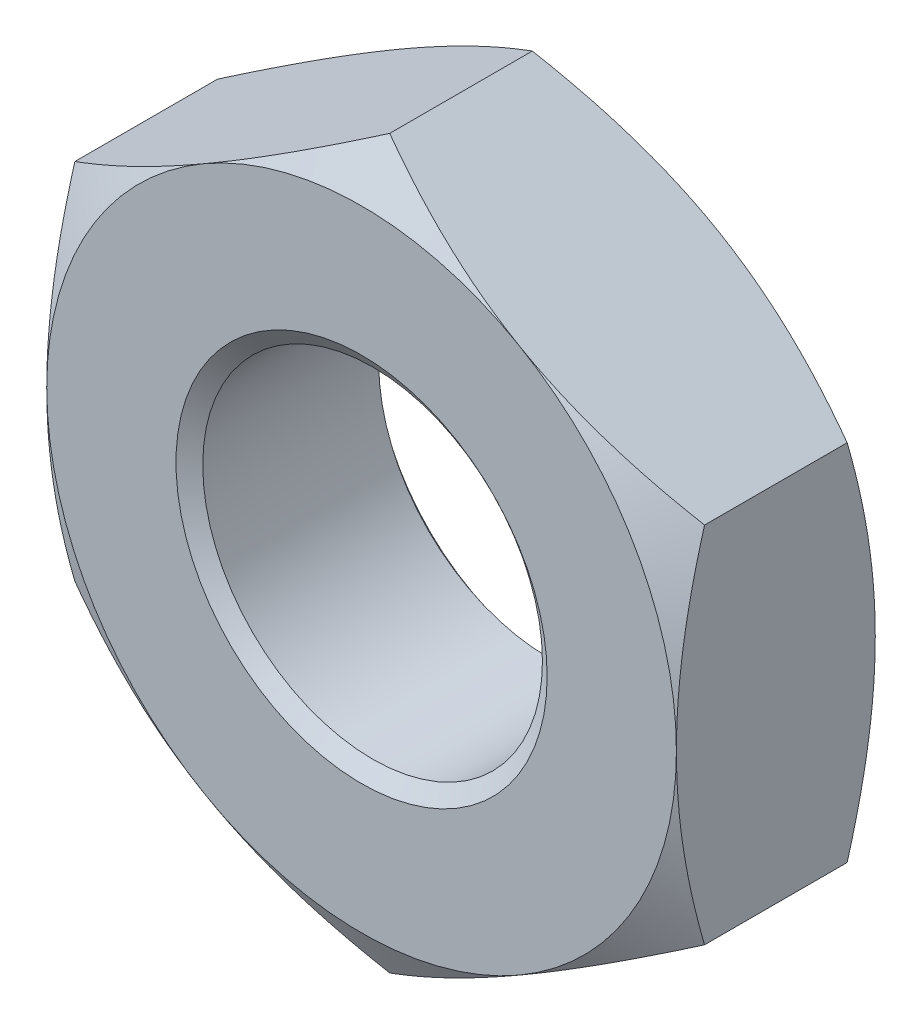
ISO-10303-21;
HEADER;
FILE_DESCRIPTION(('STEP AP214'),'2;1');
FILE_NAME('part.step','',(''),(''),'','','');
FILE_SCHEMA(('AUTOMOTIVE_DESIGN { 1 0 10303 214 1 1 1 1 }'));
ENDSEC;
DATA;
#1=APPLICATION_CONTEXT('core data for automotive mechanical design processes');
#2=APPLICATION_PROTOCOL_DEFINITION('international standard','automotive_design',2000,#1);
#3=PRODUCT_CONTEXT('',#1,'mechanical');
#4=PRODUCT('Part','Part','',(#3));
#5=PRODUCT_RELATED_PRODUCT_CATEGORY('part','',(#4));
#6=PRODUCT_DEFINITION_FORMATION('','',#4);
#7=PRODUCT_DEFINITION_CONTEXT('part definition',#1,'design');
#8=PRODUCT_DEFINITION('design','',#6,#7);
#9=PRODUCT_DEFINITION_SHAPE('','',#8);
#10=(LENGTH_UNIT() NAMED_UNIT(*) SI_UNIT(.MILLI.,.METRE.));
#11=(NAMED_UNIT(*) PLANE_ANGLE_UNIT() SI_UNIT($,.RADIAN.));
#12=(NAMED_UNIT(*) SI_UNIT($,.STERADIAN.) SOLID_ANGLE_UNIT());
#13=UNCERTAINTY_MEASURE_WITH_UNIT(LENGTH_MEASURE(1.E-05),#10,'distance_accuracy_value','');
#14=(GEOMETRIC_REPRESENTATION_CONTEXT(3) GLOBAL_UNCERTAINTY_ASSIGNED_CONTEXT((#13)) GLOBAL_UNIT_ASSIGNED_CONTEXT((#10,
#11,#12)) REPRESENTATION_CONTEXT('',''));
#15=CARTESIAN_POINT('',(0.,0.,0.));
#16=DIRECTION('',(0.,0.,1.));
#17=DIRECTION('',(1.,0.,0.));
#18=AXIS2_PLACEMENT_3D('',#15,#16,#17);
#19=CARTESIAN_POINT('',(0.,0.,-6.));
#20=DIRECTION('',(0.,0.,1.));
#21=DIRECTION('',(1.,0.,0.));
#22=AXIS2_PLACEMENT_3D('',#19,#20,#21);
#23=CYLINDRICAL_SURFACE('',#22,5.125);
#24=CARTESIAN_POINT('',(0.,0.,-0.332598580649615));
#25=DIRECTION('',(0.,0.,1.));
#26=DIRECTION('',(1.,0.,0.));
#27=AXIS2_PLACEMENT_3D('',#24,#25,#26);
#28=CIRCLE('',#27,5.125);
#29=CARTESIAN_POINT('',(5.125,0.,-0.332598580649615));
#30=VERTEX_POINT('',#29);
#31=EDGE_CURVE('E197',#30,#30,#28,.F.);
#32=ORIENTED_EDGE('',*,*,#31,.F.);
#33=EDGE_LOOP('',(#32));
#34=FACE_BOUND('',#33,.T.);
#35=CARTESIAN_POINT('',(0.,0.,-5.64200141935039));
#36=DIRECTION('',(0.,0.,-1.));
#37=DIRECTION('',(-1.,0.,0.));
#38=AXIS2_PLACEMENT_3D('',#35,#36,#37);
#39=CIRCLE('',#38,5.125);
#40=CARTESIAN_POINT('',(-5.125,0.,-5.64200141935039));
#41=VERTEX_POINT('',#40);
#42=EDGE_CURVE('E50',#41,#41,#39,.F.);
#43=ORIENTED_EDGE('',*,*,#42,.F.);
#44=EDGE_LOOP('',(#43));
#45=FACE_BOUND('',#44,.T.);
#46=ADVANCED_FACE('F45',(#34,#45),#23,.F.);
#47=CARTESIAN_POINT('',(0.,10.9696551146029,-6.));
#48=DIRECTION('',(-0.500000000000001,0.866025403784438,0.));
#49=DIRECTION('',(-0.866025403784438,-0.500000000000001,0.));
#50=AXIS2_PLACEMENT_3D('',#47,#48,#49);
#51=PLANE('',#50);
#52=DIRECTION('',(0.,0.,1.));
#53=VECTOR('',#52,1.);
#54=CARTESIAN_POINT('',(-9.5,5.48482755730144,-6.));
#55=LINE('',#54,#53);
#56=CARTESIAN_POINT('',(-9.5,5.48482755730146,-5.15149422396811));
#57=VERTEX_POINT('',#56);
#58=CARTESIAN_POINT('',(-9.5,5.48482755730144,-0.848505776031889));
#59=VERTEX_POINT('',#58);
#60=EDGE_CURVE('E184',#57,#59,#55,.T.);
#61=ORIENTED_EDGE('',*,*,#60,.T.);
#62=CARTESIAN_POINT('',(-9.5002,5.4847120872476,-0.848572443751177));
#63=CARTESIAN_POINT('',(-9.2913692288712,5.60528058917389,-0.778973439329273));
#64=CARTESIAN_POINT('',(-9.08175982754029,5.72629863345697,-0.712533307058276));
#65=CARTESIAN_POINT('',(-8.66086011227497,5.96930519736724,-0.586847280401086));
#66=CARTESIAN_POINT('',(-8.44956926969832,6.09129402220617,-0.527603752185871));
#67=CARTESIAN_POINT('',(-7.81229220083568,6.45922610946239,-0.361814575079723));
#68=CARTESIAN_POINT('',(-7.38379023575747,6.70662183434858,-0.267514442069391));
#69=CARTESIAN_POINT('',(-6.74255666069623,7.07683821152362,-0.156938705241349));
#70=CARTESIAN_POINT('',(-6.53174078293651,7.19855281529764,-0.125439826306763));
#71=CARTESIAN_POINT('',(-6.10913296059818,7.44254555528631,-0.0726182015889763));
#72=CARTESIAN_POINT('',(-5.89734099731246,7.56482370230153,-0.0512956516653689));
#73=CARTESIAN_POINT('',(-5.47340378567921,7.80958396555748,-0.0193730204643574));
#74=CARTESIAN_POINT('',(-5.26125925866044,7.93206566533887,-0.00876019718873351));
#75=CARTESIAN_POINT('',(-4.83677424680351,8.17714220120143,0.00151746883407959));
#76=CARTESIAN_POINT('',(-4.62443376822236,8.29973703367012,0.00118264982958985));
#77=CARTESIAN_POINT('',(-4.22745800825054,8.5289310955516,-0.00967336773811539));
#78=CARTESIAN_POINT('',(-4.04279470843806,8.63554650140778,-0.0188702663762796));
#79=CARTESIAN_POINT('',(-3.67389999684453,8.84852796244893,-0.0453653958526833));
#80=CARTESIAN_POINT('',(-3.48966861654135,8.95489399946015,-0.0626641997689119));
#81=CARTESIAN_POINT('',(-2.93768832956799,9.27357996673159,-0.126304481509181));
#82=CARTESIAN_POINT('',(-2.57091646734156,9.4853358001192,-0.184381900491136));
#83=CARTESIAN_POINT('',(-1.83348217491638,9.91109368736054,-0.329576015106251));
#84=CARTESIAN_POINT('',(-1.46291385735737,10.1250414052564,-0.417308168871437));
#85=CARTESIAN_POINT('',(-0.72730328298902,10.5497463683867,-0.616423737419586));
#86=CARTESIAN_POINT('',(-0.362251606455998,10.7605090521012,-0.727760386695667));
#87=CARTESIAN_POINT('',(0.000199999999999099,10.9697705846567,-0.848572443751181));
#88=B_SPLINE_CURVE_WITH_KNOTS('',3,(#62,#63,#64,#65,#66,#67,#68,#69,#70,#71,#72,#73,#74,#75,#76,
#77,#78,#79,#80,#81,#82,#83,#84,#85,#86,#87),.UNSPECIFIED.,.F.,.F.,(4,2,2,2,2,2,2,2,2,2,2,2,4),
(0.,0.752880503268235,1.50600787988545,3.0154687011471,3.75167336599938,4.48789219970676,
5.22323407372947,5.95855322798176,6.59868084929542,7.23885375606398,8.52010929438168,
9.82978009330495,11.1368800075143),.UNSPECIFIED.);
#89=CARTESIAN_POINT('',(-4.75000000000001,8.22724133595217,0.));
#90=VERTEX_POINT('',#89);
#91=EDGE_CURVE('E73',#59,#90,#88,.T.);
#92=ORIENTED_EDGE('',*,*,#91,.T.);
#93=CARTESIAN_POINT('',(0.,10.9696551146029,-0.848505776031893));
#94=VERTEX_POINT('',#93);
#95=EDGE_CURVE('E274',#90,#94,#88,.T.);
#96=ORIENTED_EDGE('',*,*,#95,.T.);
#97=DIRECTION('',(0.,0.,1.));
#98=VECTOR('',#97,1.);
#99=CARTESIAN_POINT('',(0.,10.9696551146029,-6.));
#100=LINE('',#99,#98);
#101=CARTESIAN_POINT('',(0.,10.9696551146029,-5.15149422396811));
#102=VERTEX_POINT('',#101);
#103=EDGE_CURVE('E165',#102,#94,#100,.T.);
#104=ORIENTED_EDGE('',*,*,#103,.F.);
#105=CARTESIAN_POINT('',(-9.5002,5.4847120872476,-5.15142755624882));
#106=CARTESIAN_POINT('',(-9.2913692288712,5.60528058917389,-5.22102656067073));
#107=CARTESIAN_POINT('',(-9.08175982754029,5.72629863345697,-5.28746669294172));
#108=CARTESIAN_POINT('',(-8.66086011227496,5.96930519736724,-5.41315271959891));
#109=CARTESIAN_POINT('',(-8.44956926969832,6.09129402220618,-5.47239624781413));
#110=CARTESIAN_POINT('',(-7.81229220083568,6.45922610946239,-5.63818542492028));
#111=CARTESIAN_POINT('',(-7.38379023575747,6.70662183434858,-5.73248555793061));
#112=CARTESIAN_POINT('',(-6.74255666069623,7.07683821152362,-5.84306129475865));
#113=CARTESIAN_POINT('',(-6.53174078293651,7.19855281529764,-5.87456017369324));
#114=CARTESIAN_POINT('',(-6.10913296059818,7.44254555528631,-5.92738179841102));
#115=CARTESIAN_POINT('',(-5.89734099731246,7.56482370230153,-5.94870434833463));
#116=CARTESIAN_POINT('',(-5.47340378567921,7.80958396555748,-5.98062697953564));
#117=CARTESIAN_POINT('',(-5.26125925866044,7.93206566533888,-5.99123980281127));
#118=CARTESIAN_POINT('',(-4.83677424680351,8.17714220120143,-6.00151746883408));
#119=CARTESIAN_POINT('',(-4.62443376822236,8.29973703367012,-6.00118264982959));
#120=CARTESIAN_POINT('',(-4.22745800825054,8.5289310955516,-5.99032663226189));
#121=CARTESIAN_POINT('',(-4.04279470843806,8.63554650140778,-5.98112973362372));
#122=CARTESIAN_POINT('',(-3.67389999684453,8.84852796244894,-5.95463460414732));
#123=CARTESIAN_POINT('',(-3.48966861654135,8.95489399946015,-5.93733580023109));
#124=CARTESIAN_POINT('',(-2.93768832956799,9.27357996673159,-5.87369551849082));
#125=CARTESIAN_POINT('',(-2.57091646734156,9.4853358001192,-5.81561809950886));
#126=CARTESIAN_POINT('',(-1.83348217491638,9.91109368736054,-5.67042398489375));
#127=CARTESIAN_POINT('',(-1.46291385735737,10.1250414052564,-5.58269183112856));
#128=CARTESIAN_POINT('',(-0.72730328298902,10.5497463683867,-5.38357626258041));
#129=CARTESIAN_POINT('',(-0.362251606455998,10.7605090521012,-5.27223961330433));
#130=CARTESIAN_POINT('',(0.000199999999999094,10.9697705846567,-5.15142755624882));
#131=B_SPLINE_CURVE_WITH_KNOTS('',3,(#105,#106,#107,#108,#109,#110,#111,#112,#113,#114,#115,
#116,#117,#118,#119,#120,#121,#122,#123,#124,#125,#126,#127,#128,#129,#130),.UNSPECIFIED.,.F.,
.F.,(4,2,2,2,2,2,2,2,2,2,2,2,4),(0.,0.752880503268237,1.50600787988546,3.0154687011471,
3.75167336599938,4.48789219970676,5.22323407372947,5.95855322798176,6.59868084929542,
7.23885375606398,8.52010929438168,9.82978009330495,11.1368800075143),.UNSPECIFIED.);
#132=CARTESIAN_POINT('',(-4.75000000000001,8.22724133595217,-6.));
#133=VERTEX_POINT('',#132);
#134=EDGE_CURVE('E188',#133,#102,#131,.T.);
#135=ORIENTED_EDGE('',*,*,#134,.F.);
#136=EDGE_CURVE('E298',#57,#133,#131,.T.);
#137=ORIENTED_EDGE('',*,*,#136,.F.);
#138=EDGE_LOOP('',(#61,#92,#96,#104,#135,#137));
#139=FACE_BOUND('',#138,.T.);
#140=ADVANCED_FACE('F47',(#139),#51,.T.);
#141=CARTESIAN_POINT('',(9.5,5.48482755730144,-6.));
#142=DIRECTION('',(0.500000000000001,0.866025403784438,0.));
#143=DIRECTION('',(-0.866025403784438,0.500000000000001,0.));
#144=AXIS2_PLACEMENT_3D('',#141,#142,#143);
#145=PLANE('',#144);
#146=ORIENTED_EDGE('',*,*,#103,.T.);
#147=CARTESIAN_POINT('',(-0.000200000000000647,10.9697705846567,-0.848572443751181));
#148=CARTESIAN_POINT('',(0.208630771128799,10.8492020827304,-0.778973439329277));
#149=CARTESIAN_POINT('',(0.418240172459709,10.7281840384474,-0.712533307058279));
#150=CARTESIAN_POINT('',(0.839139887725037,10.4851774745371,-0.586847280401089));
#151=CARTESIAN_POINT('',(1.05043073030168,10.3631886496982,-0.527603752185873));
#152=CARTESIAN_POINT('',(1.68770779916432,9.99525656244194,-0.361814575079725));
#153=CARTESIAN_POINT('',(2.11620976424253,9.74786083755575,-0.267514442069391));
#154=CARTESIAN_POINT('',(2.75744333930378,9.37764446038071,-0.15693870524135));
#155=CARTESIAN_POINT('',(2.96825921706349,9.2559298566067,-0.125439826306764));
#156=CARTESIAN_POINT('',(3.39086703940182,9.01193711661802,-0.0726182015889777));
#157=CARTESIAN_POINT('',(3.60265900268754,8.88965896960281,-0.0512956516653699));
#158=CARTESIAN_POINT('',(4.0265962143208,8.64489870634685,-0.0193730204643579));
#159=CARTESIAN_POINT('',(4.23874074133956,8.52241700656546,-0.00876019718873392));
#160=CARTESIAN_POINT('',(4.66322575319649,8.2773404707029,0.00151746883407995));
#161=CARTESIAN_POINT('',(4.87556623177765,8.15474563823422,0.00118264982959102));
#162=CARTESIAN_POINT('',(5.27254199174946,7.92555157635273,-0.00967336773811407));
#163=CARTESIAN_POINT('',(5.45720529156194,7.81893617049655,-0.0188702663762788));
#164=CARTESIAN_POINT('',(5.82610000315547,7.6059547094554,-0.0453653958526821));
#165=CARTESIAN_POINT('',(6.01033138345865,7.49958867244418,-0.0626641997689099));
#166=CARTESIAN_POINT('',(6.56231167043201,7.18090270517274,-0.126304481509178));
#167=CARTESIAN_POINT('',(6.92908353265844,6.96914687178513,-0.184381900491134));
#168=CARTESIAN_POINT('',(7.66651782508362,6.5433889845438,-0.32957601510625));
#169=CARTESIAN_POINT('',(8.03708614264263,6.32944126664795,-0.417308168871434));
#170=CARTESIAN_POINT('',(8.77269671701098,5.90473630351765,-0.616423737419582));
#171=CARTESIAN_POINT('',(9.137748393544,5.69397361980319,-0.727760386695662));
#172=CARTESIAN_POINT('',(9.5002,5.4847120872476,-0.848572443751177));
#173=B_SPLINE_CURVE_WITH_KNOTS('',3,(#147,#148,#149,#150,#151,#152,#153,#154,#155,#156,#157,
#158,#159,#160,#161,#162,#163,#164,#165,#166,#167,#168,#169,#170,#171,#172),.UNSPECIFIED.,.F.,
.F.,(4,2,2,2,2,2,2,2,2,2,2,2,4),(0.,0.752880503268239,1.50600787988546,3.01546870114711,
3.75167336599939,4.48789219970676,5.22323407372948,5.95855322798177,6.59868084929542,
7.23885375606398,8.52010929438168,9.82978009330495,11.1368800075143),.UNSPECIFIED.);
#174=CARTESIAN_POINT('',(4.75000000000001,8.22724133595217,0.));
#175=VERTEX_POINT('',#174);
#176=EDGE_CURVE('E156',#94,#175,#173,.T.);
#177=ORIENTED_EDGE('',*,*,#176,.T.);
#178=CARTESIAN_POINT('',(9.5,5.48482755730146,-0.848505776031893));
#179=VERTEX_POINT('',#178);
#180=EDGE_CURVE('E141',#175,#179,#173,.T.);
#181=ORIENTED_EDGE('',*,*,#180,.T.);
#182=DIRECTION('',(0.,0.,1.));
#183=VECTOR('',#182,1.);
#184=CARTESIAN_POINT('',(9.5,5.48482755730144,-6.));
#185=LINE('',#184,#183);
#186=CARTESIAN_POINT('',(9.5,5.48482755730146,-5.15149422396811));
#187=VERTEX_POINT('',#186);
#188=EDGE_CURVE('E155',#187,#179,#185,.T.);
#189=ORIENTED_EDGE('',*,*,#188,.F.);
#190=CARTESIAN_POINT('',(-0.000200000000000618,10.9697705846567,-5.15142755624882));
#191=CARTESIAN_POINT('',(0.2086307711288,10.8492020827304,-5.22102656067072));
#192=CARTESIAN_POINT('',(0.418240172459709,10.7281840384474,-5.28746669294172));
#193=CARTESIAN_POINT('',(0.839139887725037,10.4851774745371,-5.41315271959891));
#194=CARTESIAN_POINT('',(1.05043073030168,10.3631886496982,-5.47239624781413));
#195=CARTESIAN_POINT('',(1.68770779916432,9.99525656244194,-5.63818542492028));
#196=CARTESIAN_POINT('',(2.11620976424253,9.74786083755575,-5.73248555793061));
#197=CARTESIAN_POINT('',(2.75744333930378,9.37764446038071,-5.84306129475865));
#198=CARTESIAN_POINT('',(2.96825921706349,9.2559298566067,-5.87456017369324));
#199=CARTESIAN_POINT('',(3.39086703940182,9.01193711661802,-5.92738179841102));
#200=CARTESIAN_POINT('',(3.60265900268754,8.88965896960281,-5.94870434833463));
#201=CARTESIAN_POINT('',(4.0265962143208,8.64489870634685,-5.98062697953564));
#202=CARTESIAN_POINT('',(4.23874074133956,8.52241700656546,-5.99123980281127));
#203=CARTESIAN_POINT('',(4.66322575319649,8.2773404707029,-6.00151746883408));
#204=CARTESIAN_POINT('',(4.87556623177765,8.15474563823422,-6.00118264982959));
#205=CARTESIAN_POINT('',(5.27254199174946,7.92555157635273,-5.99032663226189));
#206=CARTESIAN_POINT('',(5.45720529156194,7.81893617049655,-5.98112973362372));
#207=CARTESIAN_POINT('',(5.82610000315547,7.6059547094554,-5.95463460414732));
#208=CARTESIAN_POINT('',(6.01033138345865,7.49958867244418,-5.93733580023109));
#209=CARTESIAN_POINT('',(6.56231167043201,7.18090270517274,-5.87369551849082));
#210=CARTESIAN_POINT('',(6.92908353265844,6.96914687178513,-5.81561809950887));
#211=CARTESIAN_POINT('',(7.66651782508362,6.5433889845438,-5.67042398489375));
#212=CARTESIAN_POINT('',(8.03708614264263,6.32944126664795,-5.58269183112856));
#213=CARTESIAN_POINT('',(8.77269671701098,5.90473630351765,-5.38357626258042));
#214=CARTESIAN_POINT('',(9.137748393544,5.69397361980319,-5.27223961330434));
#215=CARTESIAN_POINT('',(9.5002,5.4847120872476,-5.15142755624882));
#216=B_SPLINE_CURVE_WITH_KNOTS('',3,(#190,#191,#192,#193,#194,#195,#196,#197,#198,#199,#200,
#201,#202,#203,#204,#205,#206,#207,#208,#209,#210,#211,#212,#213,#214,#215),.UNSPECIFIED.,.F.,
.F.,(4,2,2,2,2,2,2,2,2,2,2,2,4),(0.,0.752880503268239,1.50600787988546,3.01546870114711,
3.75167336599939,4.48789219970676,5.22323407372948,5.95855322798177,6.59868084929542,
7.23885375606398,8.52010929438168,9.82978009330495,11.1368800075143),.UNSPECIFIED.);
#217=CARTESIAN_POINT('',(4.75000000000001,8.22724133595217,-6.));
#218=VERTEX_POINT('',#217);
#219=EDGE_CURVE('E290',#218,#187,#216,.T.);
#220=ORIENTED_EDGE('',*,*,#219,.F.);
#221=EDGE_CURVE('E297',#102,#218,#216,.T.);
#222=ORIENTED_EDGE('',*,*,#221,.F.);
#223=EDGE_LOOP('',(#146,#177,#181,#189,#220,#222));
#224=FACE_BOUND('',#223,.T.);
#225=ADVANCED_FACE('F153',(#224),#145,.T.);
#226=CARTESIAN_POINT('',(9.5,5.48482755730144,-6.));
#227=DIRECTION('',(-1.,0.,0.));
#228=DIRECTION('',(0.,0.,1.));
#229=AXIS2_PLACEMENT_3D('',#226,#227,#228);
#230=PLANE('',#229);
#231=CARTESIAN_POINT('',(9.5,-14.5465709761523,-4.54600370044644));
#232=CARTESIAN_POINT('',(9.5,-14.3380268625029,-4.44519656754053));
#233=CARTESIAN_POINT('',(9.5,-14.129230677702,-4.34491115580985));
#234=CARTESIAN_POINT('',(9.5,-13.7110809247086,-4.14550353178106));
#235=CARTESIAN_POINT('',(9.5,-13.5017273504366,-4.04638133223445));
#236=CARTESIAN_POINT('',(9.5,-12.8726893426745,-3.75091045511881));
#237=CARTESIAN_POINT('',(9.5,-12.4520954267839,-3.55649036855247));
#238=CARTESIAN_POINT('',(9.5,-11.6055942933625,-3.17293577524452));
#239=CARTESIAN_POINT('',(9.5,-11.1796704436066,-2.98383788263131));
#240=CARTESIAN_POINT('',(9.5,-10.3243227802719,-2.61376109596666));
#241=CARTESIAN_POINT('',(9.5,-9.89489915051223,-2.43278177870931));
#242=CARTESIAN_POINT('',(9.5,-9.02653674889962,-2.07895754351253));
#243=CARTESIAN_POINT('',(9.5,-8.58754588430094,-1.90623976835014));
#244=CARTESIAN_POINT('',(9.5,-7.70438743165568,-1.57433108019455));
#245=CARTESIAN_POINT('',(9.5,-7.26021927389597,-1.41514167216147));
#246=CARTESIAN_POINT('',(9.5,-6.36690631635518,-1.11456802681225));
#247=CARTESIAN_POINT('',(9.5,-5.9177743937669,-0.97314593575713));
#248=CARTESIAN_POINT('',(9.5,-5.01314169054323,-0.712697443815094));
#249=CARTESIAN_POINT('',(9.5,-4.55764297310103,-0.593663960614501));
#250=CARTESIAN_POINT('',(9.5,-3.6398894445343,-0.383780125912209));
#251=CARTESIAN_POINT('',(9.5,-3.17763286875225,-0.292937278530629));
#252=CARTESIAN_POINT('',(9.5,-2.48018032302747,-0.182364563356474));
#253=CARTESIAN_POINT('',(9.5,-2.24698958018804,-0.149786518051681));
#254=CARTESIAN_POINT('',(9.5,-1.77951479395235,-0.0938352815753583));
#255=CARTESIAN_POINT('',(9.5,-1.54523086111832,-0.070461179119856));
#256=CARTESIAN_POINT('',(9.5,-1.07737258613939,-0.033546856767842));
#257=CARTESIAN_POINT('',(9.5,-0.843803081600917,-0.0199455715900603));
#258=CARTESIAN_POINT('',(9.5,-0.376297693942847,-0.00264879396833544));
#259=CARTESIAN_POINT('',(9.5,-0.14236181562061,0.00104682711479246));
#260=CARTESIAN_POINT('',(9.5,0.325389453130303,-0.00155578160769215));
#261=CARTESIAN_POINT('',(9.5,0.559204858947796,-0.00785120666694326));
#262=CARTESIAN_POINT('',(9.5,1.02636653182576,-0.030279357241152));
#263=CARTESIAN_POINT('',(9.5,1.25971277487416,-0.0464125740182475));
#264=CARTESIAN_POINT('',(9.5,1.82527222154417,-0.0971001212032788));
#265=CARTESIAN_POINT('',(9.5,2.15705089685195,-0.136583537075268));
#266=CARTESIAN_POINT('',(9.5,2.81806585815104,-0.233246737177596));
#267=CARTESIAN_POINT('',(9.5,3.14730142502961,-0.290431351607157));
#268=CARTESIAN_POINT('',(9.5,3.80295855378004,-0.420468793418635));
#269=CARTESIAN_POINT('',(9.5,4.12937714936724,-0.4933364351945));
#270=CARTESIAN_POINT('',(9.5,4.77885595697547,-0.652516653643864));
#271=CARTESIAN_POINT('',(9.5,5.10191648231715,-0.738827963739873));
#272=CARTESIAN_POINT('',(9.5,5.75263605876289,-0.925086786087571));
#273=CARTESIAN_POINT('',(9.5,6.08021372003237,-1.02531669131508));
#274=CARTESIAN_POINT('',(9.5,6.73190653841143,-1.23567979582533));
#275=CARTESIAN_POINT('',(9.5,7.05602391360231,-1.34580616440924));
#276=CARTESIAN_POINT('',(9.5,7.6994955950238,-1.5736874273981));
#277=CARTESIAN_POINT('',(9.5,8.01886644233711,-1.69139589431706));
#278=CARTESIAN_POINT('',(9.5,8.65513026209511,-1.93372164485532));
#279=CARTESIAN_POINT('',(9.5,8.97202217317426,-2.05834172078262));
#280=CARTESIAN_POINT('',(9.5,9.28776285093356,-2.18573389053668));
#281=B_SPLINE_CURVE_WITH_KNOTS('',3,(#231,#232,#233,#234,#235,#236,#237,#238,#239,#240,#241,
#242,#243,#244,#245,#246,#247,#248,#249,#250,#251,#252,#253,#254,#255,#256,#257,#258,#259,#260,
#261,#262,#263,#264,#265,#266,#267,#268,#269,#270,#271,#272,#273,#274,#275,#276,#277,#278,#279,
#280),.UNSPECIFIED.,.F.,.F.,(4,2,2,2,2,2,2,2,2,2,2,2,2,2,2,2,2,2,2,2,2,2,2,2,4),(0.,
0.694890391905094,1.38978839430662,2.7798104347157,4.17778700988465,5.57569062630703,
6.99075616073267,8.40597890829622,9.81813342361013,11.2298404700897,12.6419229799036,
13.3481360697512,14.0542792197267,14.7559707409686,15.4576531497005,16.1591386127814,
16.8606591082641,17.8624602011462,18.8645349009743,19.8675603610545,20.8704913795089,
21.8980064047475,22.9248175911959,23.9458491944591,24.9672963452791),.UNSPECIFIED.);
#282=CARTESIAN_POINT('',(9.5,-5.48482755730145,-0.848505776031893));
#283=VERTEX_POINT('',#282);
#284=CARTESIAN_POINT('',(9.5,0.,0.));
#285=VERTEX_POINT('',#284);
#286=EDGE_CURVE('E148',#283,#285,#281,.T.);
#287=ORIENTED_EDGE('',*,*,#286,.F.);
#288=DIRECTION('',(0.,0.,1.));
#289=VECTOR('',#288,1.);
#290=CARTESIAN_POINT('',(9.5,-5.48482755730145,-6.));
#291=LINE('',#290,#289);
#292=CARTESIAN_POINT('',(9.5,-5.48482755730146,-5.15149422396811));
#293=VERTEX_POINT('',#292);
#294=EDGE_CURVE('E166',#293,#283,#291,.T.);
#295=ORIENTED_EDGE('',*,*,#294,.F.);
#296=CARTESIAN_POINT('',(9.5,-14.5465709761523,-1.45399629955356));
#297=CARTESIAN_POINT('',(9.5,-14.3380268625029,-1.55480343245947));
#298=CARTESIAN_POINT('',(9.5,-14.129230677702,-1.65508884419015));
#299=CARTESIAN_POINT('',(9.5,-13.7110809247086,-1.85449646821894));
#300=CARTESIAN_POINT('',(9.5,-13.5017273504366,-1.95361866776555));
#301=CARTESIAN_POINT('',(9.5,-12.8726893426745,-2.24908954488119));
#302=CARTESIAN_POINT('',(9.5,-12.4520954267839,-2.44350963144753));
#303=CARTESIAN_POINT('',(9.5,-11.6055942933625,-2.82706422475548));
#304=CARTESIAN_POINT('',(9.5,-11.1796704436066,-3.01616211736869));
#305=CARTESIAN_POINT('',(9.5,-10.3243227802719,-3.38623890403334));
#306=CARTESIAN_POINT('',(9.5,-9.89489915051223,-3.56721822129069));
#307=CARTESIAN_POINT('',(9.5,-9.02653674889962,-3.92104245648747));
#308=CARTESIAN_POINT('',(9.5,-8.58754588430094,-4.09376023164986));
#309=CARTESIAN_POINT('',(9.5,-7.70438743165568,-4.42566891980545));
#310=CARTESIAN_POINT('',(9.5,-7.26021927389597,-4.58485832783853));
#311=CARTESIAN_POINT('',(9.5,-6.36690631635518,-4.88543197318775));
#312=CARTESIAN_POINT('',(9.5,-5.9177743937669,-5.02685406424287));
#313=CARTESIAN_POINT('',(9.5,-5.01314169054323,-5.28730255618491));
#314=CARTESIAN_POINT('',(9.5,-4.55764297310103,-5.4063360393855));
#315=CARTESIAN_POINT('',(9.5,-3.6398894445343,-5.61621987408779));
#316=CARTESIAN_POINT('',(9.5,-3.17763286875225,-5.70706272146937));
#317=CARTESIAN_POINT('',(9.5,-2.48018032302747,-5.81763543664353));
#318=CARTESIAN_POINT('',(9.5,-2.24698958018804,-5.85021348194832));
#319=CARTESIAN_POINT('',(9.5,-1.77951479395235,-5.90616471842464));
#320=CARTESIAN_POINT('',(9.5,-1.54523086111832,-5.92953882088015));
#321=CARTESIAN_POINT('',(9.5,-1.07737258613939,-5.96645314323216));
#322=CARTESIAN_POINT('',(9.5,-0.843803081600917,-5.98005442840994));
#323=CARTESIAN_POINT('',(9.5,-0.376297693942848,-5.99735120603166));
#324=CARTESIAN_POINT('',(9.5,-0.14236181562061,-6.00104682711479));
#325=CARTESIAN_POINT('',(9.5,0.325389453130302,-5.99844421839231));
#326=CARTESIAN_POINT('',(9.5,0.559204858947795,-5.99214879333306));
#327=CARTESIAN_POINT('',(9.5,1.02636653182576,-5.96972064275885));
#328=CARTESIAN_POINT('',(9.5,1.25971277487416,-5.95358742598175));
#329=CARTESIAN_POINT('',(9.5,1.82527222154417,-5.90289987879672));
#330=CARTESIAN_POINT('',(9.5,2.15705089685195,-5.86341646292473));
#331=CARTESIAN_POINT('',(9.5,2.81806585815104,-5.76675326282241));
#332=CARTESIAN_POINT('',(9.5,3.14730142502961,-5.70956864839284));
#333=CARTESIAN_POINT('',(9.5,3.80295855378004,-5.57953120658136));
#334=CARTESIAN_POINT('',(9.5,4.12937714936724,-5.5066635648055));
#335=CARTESIAN_POINT('',(9.5,4.77885595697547,-5.34748334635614));
#336=CARTESIAN_POINT('',(9.5,5.10191648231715,-5.26117203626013));
#337=CARTESIAN_POINT('',(9.5,5.75263605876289,-5.07491321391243));
#338=CARTESIAN_POINT('',(9.5,6.08021372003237,-4.97468330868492));
#339=CARTESIAN_POINT('',(9.5,6.73190653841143,-4.76432020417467));
#340=CARTESIAN_POINT('',(9.5,7.05602391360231,-4.65419383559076));
#341=CARTESIAN_POINT('',(9.5,7.6994955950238,-4.4263125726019));
#342=CARTESIAN_POINT('',(9.5,8.01886644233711,-4.30860410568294));
#343=CARTESIAN_POINT('',(9.5,8.65513026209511,-4.06627835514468));
#344=CARTESIAN_POINT('',(9.5,8.97202217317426,-3.94165827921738));
#345=CARTESIAN_POINT('',(9.5,9.28776285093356,-3.81426610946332));
#346=B_SPLINE_CURVE_WITH_KNOTS('',3,(#296,#297,#298,#299,#300,#301,#302,#303,#304,#305,#306,
#307,#308,#309,#310,#311,#312,#313,#314,#315,#316,#317,#318,#319,#320,#321,#322,#323,#324,#325,
#326,#327,#328,#329,#330,#331,#332,#333,#334,#335,#336,#337,#338,#339,#340,#341,#342,#343,#344,
#345),.UNSPECIFIED.,.F.,.F.,(4,2,2,2,2,2,2,2,2,2,2,2,2,2,2,2,2,2,2,2,2,2,2,2,4),(0.,
0.694890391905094,1.38978839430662,2.7798104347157,4.17778700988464,5.57569062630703,
6.99075616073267,8.40597890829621,9.81813342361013,11.2298404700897,12.6419229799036,
13.3481360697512,14.0542792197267,14.7559707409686,15.4576531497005,16.1591386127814,
16.8606591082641,17.8624602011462,18.8645349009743,19.8675603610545,20.8704913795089,
21.8980064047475,22.9248175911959,23.9458491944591,24.9672963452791),.UNSPECIFIED.);
#347=CARTESIAN_POINT('',(9.5,0.,-6.));
#348=VERTEX_POINT('',#347);
#349=EDGE_CURVE('E305',#293,#348,#346,.T.);
#350=ORIENTED_EDGE('',*,*,#349,.T.);
#351=EDGE_CURVE('E163',#348,#187,#346,.T.);
#352=ORIENTED_EDGE('',*,*,#351,.T.);
#353=ORIENTED_EDGE('',*,*,#188,.T.);
#354=EDGE_CURVE('E138',#285,#179,#281,.T.);
#355=ORIENTED_EDGE('',*,*,#354,.F.);
#356=EDGE_LOOP('',(#287,#295,#350,#352,#353,#355));
#357=FACE_BOUND('',#356,.T.);
#358=ADVANCED_FACE('F160',(#357),#230,.F.);
#359=CARTESIAN_POINT('',(0.,-10.9696551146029,-6.));
#360=DIRECTION('',(0.500000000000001,-0.866025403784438,0.));
#361=DIRECTION('',(0.866025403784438,0.500000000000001,0.));
#362=AXIS2_PLACEMENT_3D('',#359,#360,#361);
#363=PLANE('',#362);
#364=ORIENTED_EDGE('',*,*,#294,.T.);
#365=CARTESIAN_POINT('',(9.5002,-5.48471208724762,-0.84857244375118));
#366=CARTESIAN_POINT('',(9.2913692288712,-5.60528058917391,-0.778973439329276));
#367=CARTESIAN_POINT('',(9.08175982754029,-5.72629863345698,-0.71253330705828));
#368=CARTESIAN_POINT('',(8.66086011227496,-5.96930519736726,-0.58684728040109));
#369=CARTESIAN_POINT('',(8.44956926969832,-6.09129402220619,-0.527603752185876));
#370=CARTESIAN_POINT('',(7.81229220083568,-6.45922610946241,-0.361814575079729));
#371=CARTESIAN_POINT('',(7.38379023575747,-6.70662183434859,-0.267514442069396));
#372=CARTESIAN_POINT('',(6.74255666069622,-7.07683821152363,-0.156938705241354));
#373=CARTESIAN_POINT('',(6.53174078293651,-7.19855281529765,-0.125439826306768));
#374=CARTESIAN_POINT('',(6.10913296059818,-7.44254555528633,-0.0726182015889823));
#375=CARTESIAN_POINT('',(5.89734099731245,-7.56482370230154,-0.0512956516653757));
#376=CARTESIAN_POINT('',(5.4734037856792,-7.8095839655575,-0.0193730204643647));
#377=CARTESIAN_POINT('',(5.26125925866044,-7.93206566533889,-0.0087601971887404));
#378=CARTESIAN_POINT('',(4.83677424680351,-8.17714220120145,0.0015174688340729));
#379=CARTESIAN_POINT('',(4.62443376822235,-8.29973703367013,0.00118264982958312));
#380=CARTESIAN_POINT('',(4.22745800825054,-8.52893109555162,-0.00967336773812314));
#381=CARTESIAN_POINT('',(4.04279470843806,-8.6355465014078,-0.0188702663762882));
#382=CARTESIAN_POINT('',(3.67389999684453,-8.84852796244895,-0.0453653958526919));
#383=CARTESIAN_POINT('',(3.48966861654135,-8.95489399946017,-0.0626641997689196));
#384=CARTESIAN_POINT('',(2.93768832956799,-9.2735799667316,-0.126304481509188));
#385=CARTESIAN_POINT('',(2.57091646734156,-9.48533580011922,-0.184381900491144));
#386=CARTESIAN_POINT('',(1.83348217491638,-9.91109368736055,-0.329576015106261));
#387=CARTESIAN_POINT('',(1.46291385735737,-10.1250414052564,-0.417308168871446));
#388=CARTESIAN_POINT('',(0.72730328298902,-10.5497463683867,-0.616423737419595));
#389=CARTESIAN_POINT('',(0.362251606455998,-10.7605090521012,-0.727760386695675));
#390=CARTESIAN_POINT('',(-0.000199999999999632,-10.9697705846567,-0.84857244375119));
#391=B_SPLINE_CURVE_WITH_KNOTS('',3,(#365,#366,#367,#368,#369,#370,#371,#372,#373,#374,#375,
#376,#377,#378,#379,#380,#381,#382,#383,#384,#385,#386,#387,#388,#389,#390),.UNSPECIFIED.,.F.,
.F.,(4,2,2,2,2,2,2,2,2,2,2,2,4),(0.,0.752880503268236,1.50600787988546,3.01546870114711,
3.75167336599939,4.48789219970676,5.22323407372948,5.95855322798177,6.59868084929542,
7.23885375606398,8.52010929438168,9.82978009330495,11.1368800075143),.UNSPECIFIED.);
#392=CARTESIAN_POINT('',(4.75000000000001,-8.22724133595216,0.));
#393=VERTEX_POINT('',#392);
#394=EDGE_CURVE('E388',#283,#393,#391,.T.);
#395=ORIENTED_EDGE('',*,*,#394,.T.);
#396=CARTESIAN_POINT('',(0.,-10.9696551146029,-0.848505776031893));
#397=VERTEX_POINT('',#396);
#398=EDGE_CURVE('E257',#393,#397,#391,.T.);
#399=ORIENTED_EDGE('',*,*,#398,.T.);
#400=DIRECTION('',(0.,0.,1.));
#401=VECTOR('',#400,1.);
#402=CARTESIAN_POINT('',(0.,-10.9696551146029,-6.));
#403=LINE('',#402,#401);
#404=CARTESIAN_POINT('',(0.,-10.9696551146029,-5.15149422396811));
#405=VERTEX_POINT('',#404);
#406=EDGE_CURVE('E173',#405,#397,#403,.T.);
#407=ORIENTED_EDGE('',*,*,#406,.F.);
#408=CARTESIAN_POINT('',(9.5002,-5.48471208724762,-5.15142755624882));
#409=CARTESIAN_POINT('',(9.2913692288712,-5.60528058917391,-5.22102656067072));
#410=CARTESIAN_POINT('',(9.08175982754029,-5.72629863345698,-5.28746669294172));
#411=CARTESIAN_POINT('',(8.66086011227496,-5.96930519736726,-5.41315271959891));
#412=CARTESIAN_POINT('',(8.44956926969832,-6.09129402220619,-5.47239624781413));
#413=CARTESIAN_POINT('',(7.81229220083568,-6.45922610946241,-5.63818542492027));
#414=CARTESIAN_POINT('',(7.38379023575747,-6.70662183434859,-5.7324855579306));
#415=CARTESIAN_POINT('',(6.74255666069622,-7.07683821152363,-5.84306129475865));
#416=CARTESIAN_POINT('',(6.53174078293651,-7.19855281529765,-5.87456017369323));
#417=CARTESIAN_POINT('',(6.10913296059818,-7.44254555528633,-5.92738179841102));
#418=CARTESIAN_POINT('',(5.89734099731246,-7.56482370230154,-5.94870434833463));
#419=CARTESIAN_POINT('',(5.4734037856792,-7.8095839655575,-5.98062697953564));
#420=CARTESIAN_POINT('',(5.26125925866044,-7.93206566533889,-5.99123980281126));
#421=CARTESIAN_POINT('',(4.83677424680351,-8.17714220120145,-6.00151746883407));
#422=CARTESIAN_POINT('',(4.62443376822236,-8.29973703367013,-6.00118264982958));
#423=CARTESIAN_POINT('',(4.22745800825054,-8.52893109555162,-5.99032663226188));
#424=CARTESIAN_POINT('',(4.04279470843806,-8.6355465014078,-5.98112973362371));
#425=CARTESIAN_POINT('',(3.67389999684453,-8.84852796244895,-5.95463460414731));
#426=CARTESIAN_POINT('',(3.48966861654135,-8.95489399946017,-5.93733580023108));
#427=CARTESIAN_POINT('',(2.93768832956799,-9.2735799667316,-5.87369551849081));
#428=CARTESIAN_POINT('',(2.57091646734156,-9.48533580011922,-5.81561809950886));
#429=CARTESIAN_POINT('',(1.83348217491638,-9.91109368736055,-5.67042398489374));
#430=CARTESIAN_POINT('',(1.46291385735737,-10.1250414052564,-5.58269183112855));
#431=CARTESIAN_POINT('',(0.72730328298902,-10.5497463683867,-5.38357626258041));
#432=CARTESIAN_POINT('',(0.362251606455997,-10.7605090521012,-5.27223961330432));
#433=CARTESIAN_POINT('',(-0.000199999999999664,-10.9697705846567,-5.15142755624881));
#434=B_SPLINE_CURVE_WITH_KNOTS('',3,(#408,#409,#410,#411,#412,#413,#414,#415,#416,#417,#418,
#419,#420,#421,#422,#423,#424,#425,#426,#427,#428,#429,#430,#431,#432,#433),.UNSPECIFIED.,.F.,
.F.,(4,2,2,2,2,2,2,2,2,2,2,2,4),(0.,0.752880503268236,1.50600787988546,3.01546870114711,
3.75167336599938,4.48789219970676,5.22323407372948,5.95855322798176,6.59868084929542,
7.23885375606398,8.52010929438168,9.82978009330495,11.1368800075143),.UNSPECIFIED.);
#435=CARTESIAN_POINT('',(4.75000000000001,-8.22724133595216,-6.));
#436=VERTEX_POINT('',#435);
#437=EDGE_CURVE('E313',#436,#405,#434,.T.);
#438=ORIENTED_EDGE('',*,*,#437,.F.);
#439=EDGE_CURVE('E312',#293,#436,#434,.T.);
#440=ORIENTED_EDGE('',*,*,#439,.F.);
#441=EDGE_LOOP('',(#364,#395,#399,#407,#438,#440));
#442=FACE_BOUND('',#441,.T.);
#443=ADVANCED_FACE('F326',(#442),#363,.T.);
#444=CARTESIAN_POINT('',(-9.5,-5.48482755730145,-6.));
#445=DIRECTION('',(-0.500000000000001,-0.866025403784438,0.));
#446=DIRECTION('',(0.866025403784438,-0.500000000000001,0.));
#447=AXIS2_PLACEMENT_3D('',#444,#445,#446);
#448=PLANE('',#447);
#449=ORIENTED_EDGE('',*,*,#406,.T.);
#450=CARTESIAN_POINT('',(0.0002,-10.9697705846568,-0.848572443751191));
#451=CARTESIAN_POINT('',(-0.2086307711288,-10.8492020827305,-0.778973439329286));
#452=CARTESIAN_POINT('',(-0.418240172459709,-10.7281840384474,-0.712533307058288));
#453=CARTESIAN_POINT('',(-0.839139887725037,-10.4851774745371,-0.586847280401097));
#454=CARTESIAN_POINT('',(-1.05043073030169,-10.3631886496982,-0.527603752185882));
#455=CARTESIAN_POINT('',(-1.68770779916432,-9.99525656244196,-0.361814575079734));
#456=CARTESIAN_POINT('',(-2.11620976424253,-9.74786083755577,-0.267514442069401));
#457=CARTESIAN_POINT('',(-2.75744333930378,-9.37764446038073,-0.156938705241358));
#458=CARTESIAN_POINT('',(-2.9682592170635,-9.25592985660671,-0.125439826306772));
#459=CARTESIAN_POINT('',(-3.39086703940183,-9.01193711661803,-0.0726182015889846));
#460=CARTESIAN_POINT('',(-3.60265900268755,-8.88965896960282,-0.0512956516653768));
#461=CARTESIAN_POINT('',(-4.0265962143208,-8.64489870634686,-0.019373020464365));
#462=CARTESIAN_POINT('',(-4.23874074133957,-8.52241700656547,-0.00876019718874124));
#463=CARTESIAN_POINT('',(-4.6632257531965,-8.27734047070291,0.00151746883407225));
#464=CARTESIAN_POINT('',(-4.87556623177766,-8.15474563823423,0.00118264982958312));
#465=CARTESIAN_POINT('',(-5.27254199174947,-7.92555157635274,-0.00967336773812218));
#466=CARTESIAN_POINT('',(-5.45720529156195,-7.81893617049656,-0.0188702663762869));
#467=CARTESIAN_POINT('',(-5.82610000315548,-7.60595470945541,-0.04536539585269));
#468=CARTESIAN_POINT('',(-6.01033138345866,-7.49958867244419,-0.0626641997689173));
#469=CARTESIAN_POINT('',(-6.56231167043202,-7.18090270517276,-0.126304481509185));
#470=CARTESIAN_POINT('',(-6.92908353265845,-6.96914687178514,-0.184381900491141));
#471=CARTESIAN_POINT('',(-7.66651782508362,-6.54338898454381,-0.329576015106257));
#472=CARTESIAN_POINT('',(-8.03708614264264,-6.32944126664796,-0.417308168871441));
#473=CARTESIAN_POINT('',(-8.77269671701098,-5.90473630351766,-0.616423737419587));
#474=CARTESIAN_POINT('',(-9.13774839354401,-5.6939736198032,-0.727760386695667));
#475=CARTESIAN_POINT('',(-9.5002,-5.48471208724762,-0.84857244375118));
#476=B_SPLINE_CURVE_WITH_KNOTS('',3,(#450,#451,#452,#453,#454,#455,#456,#457,#458,#459,#460,
#461,#462,#463,#464,#465,#466,#467,#468,#469,#470,#471,#472,#473,#474,#475),.UNSPECIFIED.,.F.,
.F.,(4,2,2,2,2,2,2,2,2,2,2,2,4),(0.,0.752880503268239,1.50600787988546,3.01546870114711,
3.75167336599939,4.48789219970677,5.22323407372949,5.95855322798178,6.59868084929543,
7.23885375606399,8.52010929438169,9.82978009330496,11.1368800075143),.UNSPECIFIED.);
#477=CARTESIAN_POINT('',(-4.75000000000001,-8.22724133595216,0.));
#478=VERTEX_POINT('',#477);
#479=EDGE_CURVE('E392',#397,#478,#476,.T.);
#480=ORIENTED_EDGE('',*,*,#479,.T.);
#481=CARTESIAN_POINT('',(-9.5,-5.48482755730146,-0.848505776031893));
#482=VERTEX_POINT('',#481);
#483=EDGE_CURVE('E229',#478,#482,#476,.T.);
#484=ORIENTED_EDGE('',*,*,#483,.T.);
#485=DIRECTION('',(0.,0.,1.));
#486=VECTOR('',#485,1.);
#487=CARTESIAN_POINT('',(-9.5,-5.48482755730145,-6.));
#488=LINE('',#487,#486);
#489=CARTESIAN_POINT('',(-9.5,-5.48482755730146,-5.15149422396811));
#490=VERTEX_POINT('',#489);
#491=EDGE_CURVE('E180',#490,#482,#488,.T.);
#492=ORIENTED_EDGE('',*,*,#491,.F.);
#493=CARTESIAN_POINT('',(0.0002,-10.9697705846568,-5.15142755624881));
#494=CARTESIAN_POINT('',(-0.2086307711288,-10.8492020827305,-5.22102656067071));
#495=CARTESIAN_POINT('',(-0.418240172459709,-10.7281840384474,-5.28746669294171));
#496=CARTESIAN_POINT('',(-0.839139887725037,-10.4851774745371,-5.4131527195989));
#497=CARTESIAN_POINT('',(-1.05043073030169,-10.3631886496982,-5.47239624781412));
#498=CARTESIAN_POINT('',(-1.68770779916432,-9.99525656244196,-5.63818542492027));
#499=CARTESIAN_POINT('',(-2.11620976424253,-9.74786083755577,-5.7324855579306));
#500=CARTESIAN_POINT('',(-2.75744333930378,-9.37764446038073,-5.84306129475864));
#501=CARTESIAN_POINT('',(-2.9682592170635,-9.25592985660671,-5.87456017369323));
#502=CARTESIAN_POINT('',(-3.39086703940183,-9.01193711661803,-5.92738179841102));
#503=CARTESIAN_POINT('',(-3.60265900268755,-8.88965896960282,-5.94870434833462));
#504=CARTESIAN_POINT('',(-4.0265962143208,-8.64489870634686,-5.98062697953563));
#505=CARTESIAN_POINT('',(-4.23874074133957,-8.52241700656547,-5.99123980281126));
#506=CARTESIAN_POINT('',(-4.6632257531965,-8.27734047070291,-6.00151746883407));
#507=CARTESIAN_POINT('',(-4.87556623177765,-8.15474563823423,-6.00118264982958));
#508=CARTESIAN_POINT('',(-5.27254199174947,-7.92555157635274,-5.99032663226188));
#509=CARTESIAN_POINT('',(-5.45720529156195,-7.81893617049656,-5.98112973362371));
#510=CARTESIAN_POINT('',(-5.82610000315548,-7.60595470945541,-5.95463460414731));
#511=CARTESIAN_POINT('',(-6.01033138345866,-7.49958867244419,-5.93733580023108));
#512=CARTESIAN_POINT('',(-6.56231167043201,-7.18090270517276,-5.87369551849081));
#513=CARTESIAN_POINT('',(-6.92908353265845,-6.96914687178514,-5.81561809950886));
#514=CARTESIAN_POINT('',(-7.66651782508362,-6.54338898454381,-5.67042398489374));
#515=CARTESIAN_POINT('',(-8.03708614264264,-6.32944126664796,-5.58269183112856));
#516=CARTESIAN_POINT('',(-8.77269671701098,-5.90473630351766,-5.38357626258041));
#517=CARTESIAN_POINT('',(-9.13774839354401,-5.6939736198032,-5.27223961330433));
#518=CARTESIAN_POINT('',(-9.5002,-5.48471208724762,-5.15142755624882));
#519=B_SPLINE_CURVE_WITH_KNOTS('',3,(#493,#494,#495,#496,#497,#498,#499,#500,#501,#502,#503,
#504,#505,#506,#507,#508,#509,#510,#511,#512,#513,#514,#515,#516,#517,#518),.UNSPECIFIED.,.F.,
.F.,(4,2,2,2,2,2,2,2,2,2,2,2,4),(0.,0.752880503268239,1.50600787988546,3.01546870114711,
3.75167336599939,4.48789219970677,5.22323407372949,5.95855322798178,6.59868084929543,
7.23885375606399,8.52010929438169,9.82978009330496,11.1368800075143),.UNSPECIFIED.);
#520=CARTESIAN_POINT('',(-4.75000000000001,-8.22724133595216,-6.));
#521=VERTEX_POINT('',#520);
#522=EDGE_CURVE('E321',#521,#490,#519,.T.);
#523=ORIENTED_EDGE('',*,*,#522,.F.);
#524=EDGE_CURVE('E320',#405,#521,#519,.T.);
#525=ORIENTED_EDGE('',*,*,#524,.F.);
#526=EDGE_LOOP('',(#449,#480,#484,#492,#523,#525));
#527=FACE_BOUND('',#526,.T.);
#528=ADVANCED_FACE('F329',(#527),#448,.T.);
#529=CARTESIAN_POINT('',(-9.5,5.48482755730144,-6.));
#530=DIRECTION('',(-1.,0.,0.));
#531=DIRECTION('',(0.,0.,1.));
#532=AXIS2_PLACEMENT_3D('',#529,#530,#531);
#533=PLANE('',#532);
#534=ORIENTED_EDGE('',*,*,#491,.T.);
#535=CARTESIAN_POINT('',(-9.5,-14.5465709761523,-4.54600370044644));
#536=CARTESIAN_POINT('',(-9.5,-14.3380268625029,-4.44519656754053));
#537=CARTESIAN_POINT('',(-9.5,-14.129230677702,-4.34491115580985));
#538=CARTESIAN_POINT('',(-9.5,-13.7110809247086,-4.14550353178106));
#539=CARTESIAN_POINT('',(-9.5,-13.5017273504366,-4.04638133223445));
#540=CARTESIAN_POINT('',(-9.5,-12.8726893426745,-3.75091045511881));
#541=CARTESIAN_POINT('',(-9.5,-12.4520954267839,-3.55649036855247));
#542=CARTESIAN_POINT('',(-9.5,-11.6055942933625,-3.17293577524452));
#543=CARTESIAN_POINT('',(-9.5,-11.1796704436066,-2.98383788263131));
#544=CARTESIAN_POINT('',(-9.5,-10.3243227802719,-2.61376109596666));
#545=CARTESIAN_POINT('',(-9.5,-9.89489915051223,-2.43278177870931));
#546=CARTESIAN_POINT('',(-9.5,-9.02653674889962,-2.07895754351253));
#547=CARTESIAN_POINT('',(-9.5,-8.58754588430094,-1.90623976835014));
#548=CARTESIAN_POINT('',(-9.5,-7.70438743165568,-1.57433108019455));
#549=CARTESIAN_POINT('',(-9.5,-7.26021927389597,-1.41514167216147));
#550=CARTESIAN_POINT('',(-9.5,-6.36690631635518,-1.11456802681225));
#551=CARTESIAN_POINT('',(-9.5,-5.9177743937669,-0.97314593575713));
#552=CARTESIAN_POINT('',(-9.5,-5.01314169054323,-0.712697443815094));
#553=CARTESIAN_POINT('',(-9.5,-4.55764297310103,-0.593663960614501));
#554=CARTESIAN_POINT('',(-9.5,-3.6398894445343,-0.383780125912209));
#555=CARTESIAN_POINT('',(-9.5,-3.17763286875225,-0.292937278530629));
#556=CARTESIAN_POINT('',(-9.5,-2.48018032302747,-0.182364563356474));
#557=CARTESIAN_POINT('',(-9.5,-2.24698958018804,-0.149786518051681));
#558=CARTESIAN_POINT('',(-9.5,-1.77951479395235,-0.0938352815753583));
#559=CARTESIAN_POINT('',(-9.5,-1.54523086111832,-0.070461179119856));
#560=CARTESIAN_POINT('',(-9.5,-1.07737258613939,-0.033546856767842));
#561=CARTESIAN_POINT('',(-9.5,-0.843803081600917,-0.0199455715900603));
#562=CARTESIAN_POINT('',(-9.5,-0.376297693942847,-0.00264879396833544));
#563=CARTESIAN_POINT('',(-9.5,-0.14236181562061,0.00104682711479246));
#564=CARTESIAN_POINT('',(-9.5,0.325389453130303,-0.00155578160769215));
#565=CARTESIAN_POINT('',(-9.5,0.559204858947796,-0.00785120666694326));
#566=CARTESIAN_POINT('',(-9.5,1.02636653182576,-0.030279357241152));
#567=CARTESIAN_POINT('',(-9.5,1.25971277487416,-0.0464125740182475));
#568=CARTESIAN_POINT('',(-9.5,1.82527222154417,-0.0971001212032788));
#569=CARTESIAN_POINT('',(-9.5,2.15705089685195,-0.136583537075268));
#570=CARTESIAN_POINT('',(-9.5,2.81806585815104,-0.233246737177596));
#571=CARTESIAN_POINT('',(-9.5,3.14730142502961,-0.290431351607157));
#572=CARTESIAN_POINT('',(-9.5,3.80295855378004,-0.420468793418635));
#573=CARTESIAN_POINT('',(-9.5,4.12937714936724,-0.4933364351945));
#574=CARTESIAN_POINT('',(-9.5,4.77885595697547,-0.652516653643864));
#575=CARTESIAN_POINT('',(-9.5,5.10191648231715,-0.738827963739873));
#576=CARTESIAN_POINT('',(-9.5,5.75263605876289,-0.925086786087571));
#577=CARTESIAN_POINT('',(-9.5,6.08021372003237,-1.02531669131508));
#578=CARTESIAN_POINT('',(-9.5,6.73190653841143,-1.23567979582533));
#579=CARTESIAN_POINT('',(-9.5,7.05602391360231,-1.34580616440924));
#580=CARTESIAN_POINT('',(-9.5,7.6994955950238,-1.5736874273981));
#581=CARTESIAN_POINT('',(-9.5,8.01886644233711,-1.69139589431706));
#582=CARTESIAN_POINT('',(-9.5,8.65513026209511,-1.93372164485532));
#583=CARTESIAN_POINT('',(-9.5,8.97202217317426,-2.05834172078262));
#584=CARTESIAN_POINT('',(-9.5,9.28776285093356,-2.18573389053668));
#585=B_SPLINE_CURVE_WITH_KNOTS('',3,(#535,#536,#537,#538,#539,#540,#541,#542,#543,#544,#545,
#546,#547,#548,#549,#550,#551,#552,#553,#554,#555,#556,#557,#558,#559,#560,#561,#562,#563,#564,
#565,#566,#567,#568,#569,#570,#571,#572,#573,#574,#575,#576,#577,#578,#579,#580,#581,#582,#583,
#584),.UNSPECIFIED.,.F.,.F.,(4,2,2,2,2,2,2,2,2,2,2,2,2,2,2,2,2,2,2,2,2,2,2,2,4),(0.,
0.694890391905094,1.38978839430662,2.7798104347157,4.17778700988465,5.57569062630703,
6.99075616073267,8.40597890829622,9.81813342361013,11.2298404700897,12.6419229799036,
13.3481360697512,14.0542792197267,14.7559707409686,15.4576531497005,16.1591386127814,
16.8606591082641,17.8624602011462,18.8645349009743,19.8675603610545,20.8704913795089,
21.8980064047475,22.9248175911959,23.9458491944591,24.9672963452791),.UNSPECIFIED.);
#586=CARTESIAN_POINT('',(-9.5,0.,0.));
#587=VERTEX_POINT('',#586);
#588=EDGE_CURVE('E228',#482,#587,#585,.T.);
#589=ORIENTED_EDGE('',*,*,#588,.T.);
#590=EDGE_CURVE('E220',#587,#59,#585,.T.);
#591=ORIENTED_EDGE('',*,*,#590,.T.);
#592=ORIENTED_EDGE('',*,*,#60,.F.);
#593=CARTESIAN_POINT('',(-9.5,-14.5465709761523,-1.45399629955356));
#594=CARTESIAN_POINT('',(-9.5,-14.3380268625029,-1.55480343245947));
#595=CARTESIAN_POINT('',(-9.5,-14.129230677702,-1.65508884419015));
#596=CARTESIAN_POINT('',(-9.5,-13.7110809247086,-1.85449646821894));
#597=CARTESIAN_POINT('',(-9.5,-13.5017273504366,-1.95361866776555));
#598=CARTESIAN_POINT('',(-9.5,-12.8726893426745,-2.24908954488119));
#599=CARTESIAN_POINT('',(-9.5,-12.4520954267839,-2.44350963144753));
#600=CARTESIAN_POINT('',(-9.5,-11.6055942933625,-2.82706422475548));
#601=CARTESIAN_POINT('',(-9.5,-11.1796704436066,-3.01616211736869));
#602=CARTESIAN_POINT('',(-9.5,-10.3243227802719,-3.38623890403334));
#603=CARTESIAN_POINT('',(-9.5,-9.89489915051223,-3.56721822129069));
#604=CARTESIAN_POINT('',(-9.5,-9.02653674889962,-3.92104245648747));
#605=CARTESIAN_POINT('',(-9.5,-8.58754588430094,-4.09376023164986));
#606=CARTESIAN_POINT('',(-9.5,-7.70438743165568,-4.42566891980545));
#607=CARTESIAN_POINT('',(-9.5,-7.26021927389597,-4.58485832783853));
#608=CARTESIAN_POINT('',(-9.5,-6.36690631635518,-4.88543197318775));
#609=CARTESIAN_POINT('',(-9.5,-5.9177743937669,-5.02685406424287));
#610=CARTESIAN_POINT('',(-9.5,-5.01314169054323,-5.28730255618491));
#611=CARTESIAN_POINT('',(-9.5,-4.55764297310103,-5.4063360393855));
#612=CARTESIAN_POINT('',(-9.5,-3.6398894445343,-5.61621987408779));
#613=CARTESIAN_POINT('',(-9.5,-3.17763286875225,-5.70706272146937));
#614=CARTESIAN_POINT('',(-9.5,-2.48018032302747,-5.81763543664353));
#615=CARTESIAN_POINT('',(-9.5,-2.24698958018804,-5.85021348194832));
#616=CARTESIAN_POINT('',(-9.5,-1.77951479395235,-5.90616471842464));
#617=CARTESIAN_POINT('',(-9.5,-1.54523086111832,-5.92953882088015));
#618=CARTESIAN_POINT('',(-9.5,-1.07737258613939,-5.96645314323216));
#619=CARTESIAN_POINT('',(-9.5,-0.843803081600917,-5.98005442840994));
#620=CARTESIAN_POINT('',(-9.5,-0.376297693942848,-5.99735120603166));
#621=CARTESIAN_POINT('',(-9.5,-0.14236181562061,-6.00104682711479));
#622=CARTESIAN_POINT('',(-9.5,0.325389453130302,-5.99844421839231));
#623=CARTESIAN_POINT('',(-9.5,0.559204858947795,-5.99214879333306));
#624=CARTESIAN_POINT('',(-9.5,1.02636653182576,-5.96972064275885));
#625=CARTESIAN_POINT('',(-9.5,1.25971277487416,-5.95358742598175));
#626=CARTESIAN_POINT('',(-9.5,1.82527222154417,-5.90289987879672));
#627=CARTESIAN_POINT('',(-9.5,2.15705089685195,-5.86341646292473));
#628=CARTESIAN_POINT('',(-9.5,2.81806585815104,-5.76675326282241));
#629=CARTESIAN_POINT('',(-9.5,3.14730142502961,-5.70956864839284));
#630=CARTESIAN_POINT('',(-9.5,3.80295855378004,-5.57953120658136));
#631=CARTESIAN_POINT('',(-9.5,4.12937714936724,-5.5066635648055));
#632=CARTESIAN_POINT('',(-9.5,4.77885595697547,-5.34748334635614));
#633=CARTESIAN_POINT('',(-9.5,5.10191648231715,-5.26117203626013));
#634=CARTESIAN_POINT('',(-9.5,5.75263605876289,-5.07491321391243));
#635=CARTESIAN_POINT('',(-9.5,6.08021372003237,-4.97468330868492));
#636=CARTESIAN_POINT('',(-9.5,6.73190653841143,-4.76432020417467));
#637=CARTESIAN_POINT('',(-9.5,7.05602391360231,-4.65419383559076));
#638=CARTESIAN_POINT('',(-9.5,7.6994955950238,-4.4263125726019));
#639=CARTESIAN_POINT('',(-9.5,8.01886644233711,-4.30860410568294));
#640=CARTESIAN_POINT('',(-9.5,8.65513026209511,-4.06627835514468));
#641=CARTESIAN_POINT('',(-9.5,8.97202217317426,-3.94165827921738));
#642=CARTESIAN_POINT('',(-9.5,9.28776285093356,-3.81426610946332));
#643=B_SPLINE_CURVE_WITH_KNOTS('',3,(#593,#594,#595,#596,#597,#598,#599,#600,#601,#602,#603,
#604,#605,#606,#607,#608,#609,#610,#611,#612,#613,#614,#615,#616,#617,#618,#619,#620,#621,#622,
#623,#624,#625,#626,#627,#628,#629,#630,#631,#632,#633,#634,#635,#636,#637,#638,#639,#640,#641,
#642),.UNSPECIFIED.,.F.,.F.,(4,2,2,2,2,2,2,2,2,2,2,2,2,2,2,2,2,2,2,2,2,2,2,2,4),(0.,
0.694890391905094,1.38978839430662,2.7798104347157,4.17778700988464,5.57569062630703,
6.99075616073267,8.40597890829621,9.81813342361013,11.2298404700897,12.6419229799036,
13.3481360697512,14.0542792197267,14.7559707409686,15.4576531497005,16.1591386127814,
16.8606591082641,17.8624602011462,18.8645349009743,19.8675603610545,20.8704913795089,
21.8980064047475,22.9248175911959,23.9458491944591,24.9672963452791),.UNSPECIFIED.);
#644=CARTESIAN_POINT('',(-9.5,0.,-6.));
#645=VERTEX_POINT('',#644);
#646=EDGE_CURVE('E369',#645,#57,#643,.T.);
#647=ORIENTED_EDGE('',*,*,#646,.F.);
#648=EDGE_CURVE('E380',#490,#645,#643,.T.);
#649=ORIENTED_EDGE('',*,*,#648,.F.);
#650=EDGE_LOOP('',(#534,#589,#591,#592,#647,#649));
#651=FACE_BOUND('',#650,.T.);
#652=ADVANCED_FACE('F236',(#651),#533,.T.);
#653=CARTESIAN_POINT('',(-19.,0.,0.));
#654=DIRECTION('',(0.,0.,1.));
#655=DIRECTION('',(1.,0.,0.));
#656=AXIS2_PLACEMENT_3D('',#653,#654,#655);
#657=PLANE('',#656);
#658=CARTESIAN_POINT('',(0.,0.,0.));
#659=DIRECTION('',(0.,0.,1.));
#660=DIRECTION('',(1.,0.,0.));
#661=AXIS2_PLACEMENT_3D('',#658,#659,#660);
#662=CIRCLE('',#661,5.6);
#663=CARTESIAN_POINT('',(5.6,0.,0.));
#664=VERTEX_POINT('',#663);
#665=EDGE_CURVE('E200',#664,#664,#662,.T.);
#666=ORIENTED_EDGE('',*,*,#665,.F.);
#667=EDGE_LOOP('',(#666));
#668=FACE_BOUND('',#667,.T.);
#669=CARTESIAN_POINT('',(0.,0.,0.));
#670=DIRECTION('',(0.,0.,1.));
#671=DIRECTION('',(1.,0.,0.));
#672=AXIS2_PLACEMENT_3D('',#669,#670,#671);
#673=CIRCLE('',#672,9.5);
#674=EDGE_CURVE('E58',#393,#285,#673,.T.);
#675=ORIENTED_EDGE('',*,*,#674,.T.);
#676=CARTESIAN_POINT('',(0.,0.,0.));
#677=DIRECTION('',(0.,0.,1.));
#678=DIRECTION('',(1.,0.,0.));
#679=AXIS2_PLACEMENT_3D('',#676,#677,#678);
#680=CIRCLE('',#679,9.5);
#681=EDGE_CURVE('E65',#285,#175,#680,.T.);
#682=ORIENTED_EDGE('',*,*,#681,.T.);
#683=EDGE_CURVE('E11',#175,#90,#673,.T.);
#684=ORIENTED_EDGE('',*,*,#683,.T.);
#685=EDGE_CURVE('E56',#90,#587,#673,.T.);
#686=ORIENTED_EDGE('',*,*,#685,.T.);
#687=EDGE_CURVE('E404',#587,#478,#673,.T.);
#688=ORIENTED_EDGE('',*,*,#687,.T.);
#689=EDGE_CURVE('E196',#478,#393,#673,.T.);
#690=ORIENTED_EDGE('',*,*,#689,.T.);
#691=EDGE_LOOP('',(#675,#682,#684,#686,#688,#690));
#692=FACE_BOUND('',#691,.T.);
#693=ADVANCED_FACE('F286',(#668,#692),#657,.T.);
#694=CARTESIAN_POINT('',(-19.,0.,-6.));
#695=DIRECTION('',(0.,0.,1.));
#696=DIRECTION('',(1.,0.,0.));
#697=AXIS2_PLACEMENT_3D('',#694,#695,#696);
#698=PLANE('',#697);
#699=CARTESIAN_POINT('',(0.,0.,-6.));
#700=DIRECTION('',(0.,0.,1.));
#701=DIRECTION('',(1.,0.,0.));
#702=AXIS2_PLACEMENT_3D('',#699,#700,#701);
#703=CIRCLE('',#702,5.6);
#704=CARTESIAN_POINT('',(5.6,0.,-6.));
#705=VERTEX_POINT('',#704);
#706=EDGE_CURVE('E201',#705,#705,#703,.F.);
#707=ORIENTED_EDGE('',*,*,#706,.F.);
#708=EDGE_LOOP('',(#707));
#709=FACE_BOUND('',#708,.T.);
#710=CARTESIAN_POINT('',(0.,0.,-6.));
#711=DIRECTION('',(0.,0.,1.));
#712=DIRECTION('',(1.,0.,0.));
#713=AXIS2_PLACEMENT_3D('',#710,#711,#712);
#714=CIRCLE('',#713,9.5);
#715=EDGE_CURVE('E281',#348,#218,#714,.T.);
#716=ORIENTED_EDGE('',*,*,#715,.F.);
#717=CARTESIAN_POINT('',(0.,0.,-6.));
#718=DIRECTION('',(0.,0.,1.));
#719=DIRECTION('',(1.,0.,0.));
#720=AXIS2_PLACEMENT_3D('',#717,#718,#719);
#721=CIRCLE('',#720,9.5);
#722=EDGE_CURVE('E189',#348,#436,#721,.F.);
#723=ORIENTED_EDGE('',*,*,#722,.T.);
#724=EDGE_CURVE('E192',#436,#521,#721,.F.);
#725=ORIENTED_EDGE('',*,*,#724,.T.);
#726=EDGE_CURVE('E645',#521,#645,#721,.F.);
#727=ORIENTED_EDGE('',*,*,#726,.T.);
#728=EDGE_CURVE('E643',#645,#133,#721,.F.);
#729=ORIENTED_EDGE('',*,*,#728,.T.);
#730=EDGE_CURVE('E170',#133,#218,#721,.F.);
#731=ORIENTED_EDGE('',*,*,#730,.T.);
#732=EDGE_LOOP('',(#716,#723,#725,#727,#729,#731));
#733=FACE_BOUND('',#732,.T.);
#734=ADVANCED_FACE('F348',(#709,#733),#698,.F.);
#735=CARTESIAN_POINT('',(0.,0.,-6.));
#736=DIRECTION('',(0.,0.,1.));
#737=DIRECTION('',(1.,0.,0.));
#738=AXIS2_PLACEMENT_3D('',#735,#736,#737);
#739=CONICAL_SURFACE('',#738,9.5,1.0471975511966);
#740=ORIENTED_EDGE('',*,*,#219,.T.);
#741=ORIENTED_EDGE('',*,*,#351,.F.);
#742=ORIENTED_EDGE('',*,*,#715,.T.);
#743=EDGE_LOOP('',(#740,#741,#742));
#744=FACE_BOUND('',#743,.T.);
#745=ADVANCED_FACE('F350',(#744),#739,.T.);
#746=ORIENTED_EDGE('',*,*,#134,.T.);
#747=ORIENTED_EDGE('',*,*,#221,.T.);
#748=ORIENTED_EDGE('',*,*,#730,.F.);
#749=EDGE_LOOP('',(#746,#747,#748));
#750=FACE_BOUND('',#749,.T.);
#751=ADVANCED_FACE('F356',(#750),#739,.T.);
#752=ORIENTED_EDGE('',*,*,#136,.T.);
#753=ORIENTED_EDGE('',*,*,#728,.F.);
#754=ORIENTED_EDGE('',*,*,#646,.T.);
#755=EDGE_LOOP('',(#752,#753,#754));
#756=FACE_BOUND('',#755,.T.);
#757=ADVANCED_FACE('F428',(#756),#739,.T.);
#758=ORIENTED_EDGE('',*,*,#522,.T.);
#759=ORIENTED_EDGE('',*,*,#648,.T.);
#760=ORIENTED_EDGE('',*,*,#726,.F.);
#761=EDGE_LOOP('',(#758,#759,#760));
#762=FACE_BOUND('',#761,.T.);
#763=ADVANCED_FACE('F249',(#762),#739,.T.);
#764=ORIENTED_EDGE('',*,*,#437,.T.);
#765=ORIENTED_EDGE('',*,*,#524,.T.);
#766=ORIENTED_EDGE('',*,*,#724,.F.);
#767=EDGE_LOOP('',(#764,#765,#766));
#768=FACE_BOUND('',#767,.T.);
#769=ADVANCED_FACE('F427',(#768),#739,.T.);
#770=ORIENTED_EDGE('',*,*,#439,.T.);
#771=ORIENTED_EDGE('',*,*,#722,.F.);
#772=ORIENTED_EDGE('',*,*,#349,.F.);
#773=EDGE_LOOP('',(#770,#771,#772));
#774=FACE_BOUND('',#773,.T.);
#775=ADVANCED_FACE('F358',(#774),#739,.T.);
#776=CARTESIAN_POINT('',(0.,0.,0.));
#777=DIRECTION('',(0.,0.,-1.));
#778=DIRECTION('',(-1.,0.,0.));
#779=AXIS2_PLACEMENT_3D('',#776,#777,#778);
#780=CONICAL_SURFACE('',#779,9.5,1.0471975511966);
#781=ORIENTED_EDGE('',*,*,#286,.T.);
#782=ORIENTED_EDGE('',*,*,#674,.F.);
#783=ORIENTED_EDGE('',*,*,#394,.F.);
#784=EDGE_LOOP('',(#781,#782,#783));
#785=FACE_BOUND('',#784,.T.);
#786=ADVANCED_FACE('F412',(#785),#780,.T.);
#787=ORIENTED_EDGE('',*,*,#689,.F.);
#788=ORIENTED_EDGE('',*,*,#479,.F.);
#789=ORIENTED_EDGE('',*,*,#398,.F.);
#790=EDGE_LOOP('',(#787,#788,#789));
#791=FACE_BOUND('',#790,.T.);
#792=ADVANCED_FACE('F244',(#791),#780,.T.);
#793=ORIENTED_EDGE('',*,*,#687,.F.);
#794=ORIENTED_EDGE('',*,*,#588,.F.);
#795=ORIENTED_EDGE('',*,*,#483,.F.);
#796=EDGE_LOOP('',(#793,#794,#795));
#797=FACE_BOUND('',#796,.T.);
#798=ADVANCED_FACE('F238',(#797),#780,.T.);
#799=ORIENTED_EDGE('',*,*,#590,.F.);
#800=ORIENTED_EDGE('',*,*,#685,.F.);
#801=ORIENTED_EDGE('',*,*,#91,.F.);
#802=EDGE_LOOP('',(#799,#800,#801));
#803=FACE_BOUND('',#802,.T.);
#804=ADVANCED_FACE('F243',(#803),#780,.T.);
#805=ORIENTED_EDGE('',*,*,#683,.F.);
#806=ORIENTED_EDGE('',*,*,#176,.F.);
#807=ORIENTED_EDGE('',*,*,#95,.F.);
#808=EDGE_LOOP('',(#805,#806,#807));
#809=FACE_BOUND('',#808,.T.);
#810=ADVANCED_FACE('F246',(#809),#780,.T.);
#811=ORIENTED_EDGE('',*,*,#681,.F.);
#812=ORIENTED_EDGE('',*,*,#354,.T.);
#813=ORIENTED_EDGE('',*,*,#180,.F.);
#814=EDGE_LOOP('',(#811,#812,#813));
#815=FACE_BOUND('',#814,.T.);
#816=ADVANCED_FACE('F140',(#815),#780,.T.);
#817=CARTESIAN_POINT('',(0.,0.,-0.462136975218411));
#818=DIRECTION('',(0.,0.,1.));
#819=DIRECTION('',(1.,0.,0.));
#820=AXIS2_PLACEMENT_3D('',#817,#818,#819);
#821=CONICAL_SURFACE('',#820,4.94,0.959931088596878);
#822=ORIENTED_EDGE('',*,*,#665,.T.);
#823=EDGE_LOOP('',(#822));
#824=FACE_BOUND('',#823,.T.);
#825=ORIENTED_EDGE('',*,*,#31,.T.);
#826=EDGE_LOOP('',(#825));
#827=FACE_BOUND('',#826,.T.);
#828=ADVANCED_FACE('F247',(#824,#827),#821,.F.);
#829=CARTESIAN_POINT('',(0.,0.,-5.9746));
#830=DIRECTION('',(0.,0.,-1.));
#831=DIRECTION('',(-1.,0.,0.));
#832=AXIS2_PLACEMENT_3D('',#829,#830,#831);
#833=CONICAL_SURFACE('',#832,5.6,0.959931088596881);
#834=CARTESIAN_POINT('',(0.,0.,-5.9746));
#835=DIRECTION('',(0.,0.,1.));
#836=DIRECTION('',(1.,0.,0.));
#837=AXIS2_PLACEMENT_3D('',#834,#835,#836);
#838=CIRCLE('',#837,5.6);
#839=CARTESIAN_POINT('',(5.6,0.,-5.9746));
#840=VERTEX_POINT('',#839);
#841=EDGE_CURVE('E204',#840,#840,#838,.T.);
#842=ORIENTED_EDGE('',*,*,#841,.F.);
#843=EDGE_LOOP('',(#842));
#844=FACE_BOUND('',#843,.T.);
#845=ORIENTED_EDGE('',*,*,#42,.T.);
#846=EDGE_LOOP('',(#845));
#847=FACE_BOUND('',#846,.T.);
#848=ADVANCED_FACE('F433',(#844,#847),#833,.F.);
#849=CARTESIAN_POINT('',(0.,0.,-25.0375057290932));
#850=DIRECTION('',(0.,0.,1.));
#851=DIRECTION('',(1.,0.,0.));
#852=AXIS2_PLACEMENT_3D('',#849,#850,#851);
#853=CYLINDRICAL_SURFACE('',#852,5.6);
#854=ORIENTED_EDGE('',*,*,#841,.T.);
#855=EDGE_LOOP('',(#854));
#856=FACE_BOUND('',#855,.T.);
#857=ORIENTED_EDGE('',*,*,#706,.T.);
#858=EDGE_LOOP('',(#857));
#859=FACE_BOUND('',#858,.T.);
#860=ADVANCED_FACE('F438',(#856,#859),#853,.F.);
#861=CLOSED_SHELL('',(#46,#140,#225,#358,#443,#528,#652,#693,#734,#745,#751,#757,#763,#769,#775,
#786,#792,#798,#804,#810,#816,#828,#848,#860));
#862=MANIFOLD_SOLID_BREP('B2',#861);
#863=ADVANCED_BREP_SHAPE_REPRESENTATION('',(#18,#862),#14);
#864=SHAPE_DEFINITION_REPRESENTATION(#9,#863);
ENDSEC;
END-ISO-10303-21;
